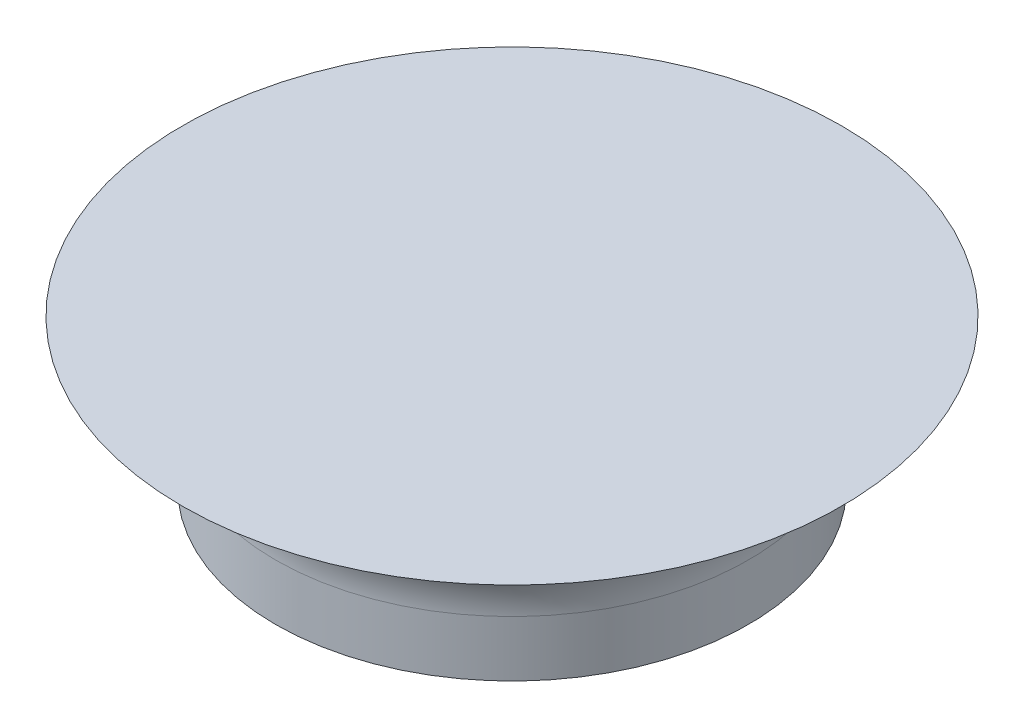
ISO-10303-21;
HEADER;
FILE_DESCRIPTION(('STEP AP214'),'2;1');
FILE_NAME('part.step','',(''),(''),'','','');
FILE_SCHEMA(('AUTOMOTIVE_DESIGN { 1 0 10303 214 1 1 1 1 }'));
ENDSEC;
DATA;
#1=APPLICATION_CONTEXT('core data for automotive mechanical design processes');
#2=APPLICATION_PROTOCOL_DEFINITION('international standard','automotive_design',2000,#1);
#3=PRODUCT_CONTEXT('',#1,'mechanical');
#4=PRODUCT('Part','Part','',(#3));
#5=PRODUCT_RELATED_PRODUCT_CATEGORY('part','',(#4));
#6=PRODUCT_DEFINITION_FORMATION('','',#4);
#7=PRODUCT_DEFINITION_CONTEXT('part definition',#1,'design');
#8=PRODUCT_DEFINITION('design','',#6,#7);
#9=PRODUCT_DEFINITION_SHAPE('','',#8);
#10=(LENGTH_UNIT() NAMED_UNIT(*) SI_UNIT(.MILLI.,.METRE.));
#11=(NAMED_UNIT(*) PLANE_ANGLE_UNIT() SI_UNIT($,.RADIAN.));
#12=(NAMED_UNIT(*) SI_UNIT($,.STERADIAN.) SOLID_ANGLE_UNIT());
#13=UNCERTAINTY_MEASURE_WITH_UNIT(LENGTH_MEASURE(1.E-05),#10,'distance_accuracy_value','');
#14=(GEOMETRIC_REPRESENTATION_CONTEXT(3) GLOBAL_UNCERTAINTY_ASSIGNED_CONTEXT((#13)) GLOBAL_UNIT_ASSIGNED_CONTEXT((#10,
#11,#12)) REPRESENTATION_CONTEXT('',''));
#15=CARTESIAN_POINT('',(0.,0.,0.));
#16=DIRECTION('',(0.,0.,1.));
#17=DIRECTION('',(1.,0.,0.));
#18=AXIS2_PLACEMENT_3D('',#15,#16,#17);
#19=CARTESIAN_POINT('',(0.,0.,0.));
#20=DIRECTION('',(0.,1.,0.));
#21=DIRECTION('',(0.,0.,1.));
#22=AXIS2_PLACEMENT_3D('',#19,#20,#21);
#23=CYLINDRICAL_SURFACE('',#22,6.35);
#24=CARTESIAN_POINT('',(0.,-2.5,0.));
#25=DIRECTION('',(0.,-1.,0.));
#26=DIRECTION('',(0.,0.,-1.));
#27=AXIS2_PLACEMENT_3D('',#24,#25,#26);
#28=CIRCLE('',#27,6.35);
#29=CARTESIAN_POINT('',(0.,-2.5,-6.35));
#30=VERTEX_POINT('',#29);
#31=EDGE_CURVE('E10',#30,#30,#28,.T.);
#32=ORIENTED_EDGE('',*,*,#31,.T.);
#33=EDGE_LOOP('',(#32));
#34=FACE_BOUND('',#33,.T.);
#35=CARTESIAN_POINT('',(0.,-4.,0.));
#36=DIRECTION('',(0.,1.,0.));
#37=DIRECTION('',(0.,0.,1.));
#38=AXIS2_PLACEMENT_3D('',#35,#36,#37);
#39=CIRCLE('',#38,6.35);
#40=CARTESIAN_POINT('',(0.,-4.,6.35));
#41=VERTEX_POINT('',#40);
#42=EDGE_CURVE('E40',#41,#41,#39,.T.);
#43=ORIENTED_EDGE('',*,*,#42,.T.);
#44=EDGE_LOOP('',(#43));
#45=FACE_BOUND('',#44,.T.);
#46=ADVANCED_FACE('F34',(#34,#45),#23,.T.);
#47=CARTESIAN_POINT('',(6.35,-4.,0.));
#48=DIRECTION('',(0.,-1.,0.));
#49=DIRECTION('',(0.,0.,-1.));
#50=AXIS2_PLACEMENT_3D('',#47,#48,#49);
#51=PLANE('',#50);
#52=ORIENTED_EDGE('',*,*,#42,.F.);
#53=EDGE_LOOP('',(#52));
#54=FACE_BOUND('',#53,.T.);
#55=ADVANCED_FACE('F55',(#54),#51,.T.);
#56=CARTESIAN_POINT('',(0.,-2.5,0.));
#57=DIRECTION('',(0.,-1.,0.));
#58=DIRECTION('',(0.,0.,-1.));
#59=AXIS2_PLACEMENT_3D('',#56,#57,#58);
#60=TOROIDAL_SURFACE('',#59,8.85,2.5);
#61=ORIENTED_EDGE('',*,*,#31,.F.);
#62=EDGE_LOOP('',(#61));
#63=FACE_BOUND('',#62,.T.);
#64=CARTESIAN_POINT('',(0.,0.,0.));
#65=DIRECTION('',(0.,-1.,0.));
#66=DIRECTION('',(0.,0.,-1.));
#67=AXIS2_PLACEMENT_3D('',#64,#65,#66);
#68=CIRCLE('',#67,8.85);
#69=CARTESIAN_POINT('',(0.,0.,-8.85));
#70=VERTEX_POINT('',#69);
#71=EDGE_CURVE('E44',#70,#70,#68,.F.);
#72=ORIENTED_EDGE('',*,*,#71,.F.);
#73=EDGE_LOOP('',(#72));
#74=FACE_BOUND('',#73,.T.);
#75=ADVANCED_FACE('F53',(#63,#74),#60,.F.);
#76=CARTESIAN_POINT('',(-25.,0.,25.));
#77=DIRECTION('',(0.,-1.,0.));
#78=DIRECTION('',(0.,0.,-1.));
#79=AXIS2_PLACEMENT_3D('',#76,#77,#78);
#80=PLANE('',#79);
#81=ORIENTED_EDGE('',*,*,#71,.T.);
#82=EDGE_LOOP('',(#81));
#83=FACE_BOUND('',#82,.T.);
#84=ADVANCED_FACE('F51',(#83),#80,.F.);
#85=CLOSED_SHELL('',(#46,#55,#75,#84));
#86=MANIFOLD_SOLID_BREP('B2',#85);
#87=ADVANCED_BREP_SHAPE_REPRESENTATION('',(#18,#86),#14);
#88=SHAPE_DEFINITION_REPRESENTATION(#9,#87);
ENDSEC;
END-ISO-10303-21;
